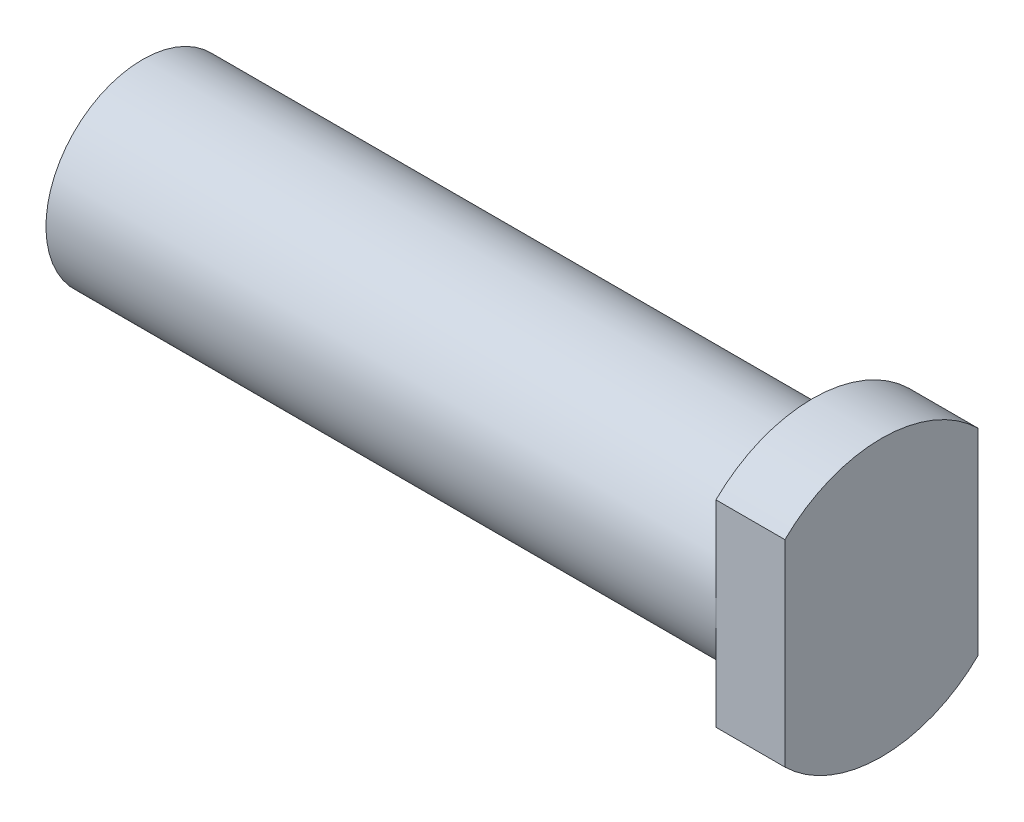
ISO-10303-21;
HEADER;
FILE_DESCRIPTION(('STEP AP214'),'2;1');
FILE_NAME('part.step','',(''),(''),'','','');
FILE_SCHEMA(('AUTOMOTIVE_DESIGN { 1 0 10303 214 1 1 1 1 }'));
ENDSEC;
DATA;
#1=APPLICATION_CONTEXT('core data for automotive mechanical design processes');
#2=APPLICATION_PROTOCOL_DEFINITION('international standard','automotive_design',2000,#1);
#3=PRODUCT_CONTEXT('',#1,'mechanical');
#4=PRODUCT('Part','Part','',(#3));
#5=PRODUCT_RELATED_PRODUCT_CATEGORY('part','',(#4));
#6=PRODUCT_DEFINITION_FORMATION('','',#4);
#7=PRODUCT_DEFINITION_CONTEXT('part definition',#1,'design');
#8=PRODUCT_DEFINITION('design','',#6,#7);
#9=PRODUCT_DEFINITION_SHAPE('','',#8);
#10=(LENGTH_UNIT() NAMED_UNIT(*) SI_UNIT(.MILLI.,.METRE.));
#11=(NAMED_UNIT(*) PLANE_ANGLE_UNIT() SI_UNIT($,.RADIAN.));
#12=(NAMED_UNIT(*) SI_UNIT($,.STERADIAN.) SOLID_ANGLE_UNIT());
#13=UNCERTAINTY_MEASURE_WITH_UNIT(LENGTH_MEASURE(1.E-05),#10,'distance_accuracy_value','');
#14=(GEOMETRIC_REPRESENTATION_CONTEXT(3) GLOBAL_UNCERTAINTY_ASSIGNED_CONTEXT((#13)) GLOBAL_UNIT_ASSIGNED_CONTEXT((#10,
#11,#12)) REPRESENTATION_CONTEXT('',''));
#15=CARTESIAN_POINT('',(0.,0.,0.));
#16=DIRECTION('',(0.,0.,1.));
#17=DIRECTION('',(1.,0.,0.));
#18=AXIS2_PLACEMENT_3D('',#15,#16,#17);
#19=CARTESIAN_POINT('',(48.5778463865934,6.99999999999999,0.));
#20=DIRECTION('',(-1.,0.,0.));
#21=DIRECTION('',(0.,-1.,0.));
#22=AXIS2_PLACEMENT_3D('',#19,#20,#21);
#23=PLANE('',#22);
#24=DIRECTION('',(0.,-1.,0.));
#25=VECTOR('',#24,1.);
#26=CARTESIAN_POINT('',(48.5778463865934,6.99999999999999,7.));
#27=LINE('',#26,#25);
#28=CARTESIAN_POINT('',(48.5778463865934,7.14142842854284,7.));
#29=VERTEX_POINT('',#28);
#30=CARTESIAN_POINT('',(48.5778463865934,0.,7.));
#31=VERTEX_POINT('',#30);
#32=EDGE_CURVE('E123',#29,#31,#27,.T.);
#33=ORIENTED_EDGE('',*,*,#32,.F.);
#34=CARTESIAN_POINT('',(48.5778463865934,0.,0.));
#35=DIRECTION('',(1.,0.,0.));
#36=DIRECTION('',(0.,1.,0.));
#37=AXIS2_PLACEMENT_3D('',#34,#35,#36);
#38=CIRCLE('',#37,9.99999999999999);
#39=CARTESIAN_POINT('',(48.5778463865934,7.14142842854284,-7.));
#40=VERTEX_POINT('',#39);
#41=EDGE_CURVE('E95',#40,#29,#38,.T.);
#42=ORIENTED_EDGE('',*,*,#41,.F.);
#43=DIRECTION('',(0.,1.,0.));
#44=VECTOR('',#43,1.);
#45=CARTESIAN_POINT('',(48.5778463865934,6.99999999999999,-7.));
#46=LINE('',#45,#44);
#47=CARTESIAN_POINT('',(48.5778463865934,0.,-7.));
#48=VERTEX_POINT('',#47);
#49=EDGE_CURVE('E105',#48,#40,#46,.T.);
#50=ORIENTED_EDGE('',*,*,#49,.F.);
#51=CARTESIAN_POINT('',(48.5778463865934,0.,0.));
#52=DIRECTION('',(1.,0.,0.));
#53=DIRECTION('',(0.,1.,0.));
#54=AXIS2_PLACEMENT_3D('',#51,#52,#53);
#55=CIRCLE('',#54,6.99999999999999);
#56=EDGE_CURVE('E109',#48,#31,#55,.T.);
#57=ORIENTED_EDGE('',*,*,#56,.T.);
#58=EDGE_LOOP('',(#33,#42,#50,#57));
#59=FACE_BOUND('',#58,.T.);
#60=ADVANCED_FACE('F38',(#59),#23,.T.);
#61=CARTESIAN_POINT('',(53.5778463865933,0.,0.));
#62=DIRECTION('',(1.,0.,0.));
#63=DIRECTION('',(0.,1.,0.));
#64=AXIS2_PLACEMENT_3D('',#61,#62,#63);
#65=CYLINDRICAL_SURFACE('',#64,9.99999999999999);
#66=DIRECTION('',(1.,0.,0.));
#67=VECTOR('',#66,1.);
#68=CARTESIAN_POINT('',(53.5778463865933,7.14142842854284,7.));
#69=LINE('',#68,#67);
#70=CARTESIAN_POINT('',(53.5778463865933,7.14142842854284,7.));
#71=VERTEX_POINT('',#70);
#72=EDGE_CURVE('E84',#71,#29,#69,.F.);
#73=ORIENTED_EDGE('',*,*,#72,.F.);
#74=CARTESIAN_POINT('',(53.5778463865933,0.,0.));
#75=DIRECTION('',(1.,0.,0.));
#76=DIRECTION('',(0.,1.,0.));
#77=AXIS2_PLACEMENT_3D('',#74,#75,#76);
#78=CIRCLE('',#77,9.99999999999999);
#79=CARTESIAN_POINT('',(53.5778463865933,7.14142842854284,-7.));
#80=VERTEX_POINT('',#79);
#81=EDGE_CURVE('E93',#80,#71,#78,.T.);
#82=ORIENTED_EDGE('',*,*,#81,.F.);
#83=DIRECTION('',(1.,0.,0.));
#84=VECTOR('',#83,1.);
#85=CARTESIAN_POINT('',(53.5778463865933,7.14142842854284,-7.));
#86=LINE('',#85,#84);
#87=EDGE_CURVE('E60',#40,#80,#86,.T.);
#88=ORIENTED_EDGE('',*,*,#87,.F.);
#89=ORIENTED_EDGE('',*,*,#41,.T.);
#90=EDGE_LOOP('',(#73,#82,#88,#89));
#91=FACE_BOUND('',#90,.T.);
#92=ADVANCED_FACE('F92',(#91),#65,.T.);
#93=CARTESIAN_POINT('',(0.,0.,0.));
#94=DIRECTION('',(-1.,0.,0.));
#95=DIRECTION('',(0.,-1.,0.));
#96=AXIS2_PLACEMENT_3D('',#93,#94,#95);
#97=PLANE('',#96);
#98=CARTESIAN_POINT('',(0.,0.,0.));
#99=DIRECTION('',(1.,0.,0.));
#100=DIRECTION('',(0.,1.,0.));
#101=AXIS2_PLACEMENT_3D('',#98,#99,#100);
#102=CIRCLE('',#101,6.99999999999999);
#103=CARTESIAN_POINT('',(0.,6.99999999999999,0.));
#104=VERTEX_POINT('',#103);
#105=EDGE_CURVE('E112',#104,#104,#102,.T.);
#106=ORIENTED_EDGE('',*,*,#105,.F.);
#107=EDGE_LOOP('',(#106));
#108=FACE_BOUND('',#107,.T.);
#109=ADVANCED_FACE('F40',(#108),#97,.T.);
#110=CARTESIAN_POINT('',(53.5778463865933,0.,0.));
#111=DIRECTION('',(1.,0.,0.));
#112=DIRECTION('',(0.,1.,0.));
#113=AXIS2_PLACEMENT_3D('',#110,#111,#112);
#114=CYLINDRICAL_SURFACE('',#113,6.99999999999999);
#115=ORIENTED_EDGE('',*,*,#105,.T.);
#116=EDGE_LOOP('',(#115));
#117=FACE_BOUND('',#116,.T.);
#118=ORIENTED_EDGE('',*,*,#56,.F.);
#119=EDGE_CURVE('E108',#31,#48,#55,.T.);
#120=ORIENTED_EDGE('',*,*,#119,.F.);
#121=EDGE_LOOP('',(#118,#120));
#122=FACE_BOUND('',#121,.T.);
#123=ADVANCED_FACE('F134',(#117,#122),#114,.T.);
#124=CARTESIAN_POINT('',(48.5778463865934,-7.14142842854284,7.));
#125=VERTEX_POINT('',#124);
#126=EDGE_CURVE('E96',#31,#125,#27,.T.);
#127=ORIENTED_EDGE('',*,*,#126,.F.);
#128=ORIENTED_EDGE('',*,*,#119,.T.);
#129=CARTESIAN_POINT('',(48.5778463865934,-7.14142842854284,-7.));
#130=VERTEX_POINT('',#129);
#131=EDGE_CURVE('E103',#130,#48,#46,.T.);
#132=ORIENTED_EDGE('',*,*,#131,.F.);
#133=EDGE_CURVE('E99',#125,#130,#38,.T.);
#134=ORIENTED_EDGE('',*,*,#133,.F.);
#135=EDGE_LOOP('',(#127,#128,#132,#134));
#136=FACE_BOUND('',#135,.T.);
#137=ADVANCED_FACE('F131',(#136),#23,.T.);
#138=DIRECTION('',(1.,0.,0.));
#139=VECTOR('',#138,1.);
#140=CARTESIAN_POINT('',(53.5778463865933,-7.14142842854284,7.));
#141=LINE('',#140,#139);
#142=CARTESIAN_POINT('',(53.5778463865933,-7.14142842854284,7.));
#143=VERTEX_POINT('',#142);
#144=EDGE_CURVE('E52',#125,#143,#141,.T.);
#145=ORIENTED_EDGE('',*,*,#144,.F.);
#146=ORIENTED_EDGE('',*,*,#133,.T.);
#147=DIRECTION('',(1.,0.,0.));
#148=VECTOR('',#147,1.);
#149=CARTESIAN_POINT('',(53.5778463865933,-7.14142842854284,-7.));
#150=LINE('',#149,#148);
#151=CARTESIAN_POINT('',(53.5778463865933,-7.14142842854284,-7.));
#152=VERTEX_POINT('',#151);
#153=EDGE_CURVE('E118',#152,#130,#150,.F.);
#154=ORIENTED_EDGE('',*,*,#153,.F.);
#155=EDGE_CURVE('E100',#143,#152,#78,.T.);
#156=ORIENTED_EDGE('',*,*,#155,.F.);
#157=EDGE_LOOP('',(#145,#146,#154,#156));
#158=FACE_BOUND('',#157,.T.);
#159=ADVANCED_FACE('F121',(#158),#65,.T.);
#160=CARTESIAN_POINT('',(53.5778463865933,9.99999999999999,0.));
#161=DIRECTION('',(1.,0.,0.));
#162=DIRECTION('',(0.,1.,0.));
#163=AXIS2_PLACEMENT_3D('',#160,#161,#162);
#164=PLANE('',#163);
#165=DIRECTION('',(0.,1.,0.));
#166=VECTOR('',#165,1.);
#167=CARTESIAN_POINT('',(53.5778463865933,9.99999999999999,7.));
#168=LINE('',#167,#166);
#169=EDGE_CURVE('E11',#143,#71,#168,.T.);
#170=ORIENTED_EDGE('',*,*,#169,.F.);
#171=ORIENTED_EDGE('',*,*,#155,.T.);
#172=DIRECTION('',(0.,-1.,0.));
#173=VECTOR('',#172,1.);
#174=CARTESIAN_POINT('',(53.5778463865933,9.99999999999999,-7.));
#175=LINE('',#174,#173);
#176=EDGE_CURVE('E46',#80,#152,#175,.T.);
#177=ORIENTED_EDGE('',*,*,#176,.F.);
#178=ORIENTED_EDGE('',*,*,#81,.T.);
#179=EDGE_LOOP('',(#170,#171,#177,#178));
#180=FACE_BOUND('',#179,.T.);
#181=ADVANCED_FACE('F98',(#180),#164,.T.);
#182=CARTESIAN_POINT('',(47.5778463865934,-9.99999999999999,-7.));
#183=DIRECTION('',(0.,0.,1.));
#184=DIRECTION('',(1.,0.,0.));
#185=AXIS2_PLACEMENT_3D('',#182,#183,#184);
#186=PLANE('',#185);
#187=ORIENTED_EDGE('',*,*,#131,.T.);
#188=ORIENTED_EDGE('',*,*,#49,.T.);
#189=ORIENTED_EDGE('',*,*,#87,.T.);
#190=ORIENTED_EDGE('',*,*,#176,.T.);
#191=ORIENTED_EDGE('',*,*,#153,.T.);
#192=EDGE_LOOP('',(#187,#188,#189,#190,#191));
#193=FACE_BOUND('',#192,.T.);
#194=ADVANCED_FACE('F117',(#193),#186,.F.);
#195=CARTESIAN_POINT('',(47.5778463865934,-9.99999999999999,7.));
#196=DIRECTION('',(0.,0.,-1.));
#197=DIRECTION('',(-1.,0.,0.));
#198=AXIS2_PLACEMENT_3D('',#195,#196,#197);
#199=PLANE('',#198);
#200=ORIENTED_EDGE('',*,*,#32,.T.);
#201=ORIENTED_EDGE('',*,*,#126,.T.);
#202=ORIENTED_EDGE('',*,*,#144,.T.);
#203=ORIENTED_EDGE('',*,*,#169,.T.);
#204=ORIENTED_EDGE('',*,*,#72,.T.);
#205=EDGE_LOOP('',(#200,#201,#202,#203,#204));
#206=FACE_BOUND('',#205,.T.);
#207=ADVANCED_FACE('F83',(#206),#199,.F.);
#208=CLOSED_SHELL('',(#60,#92,#109,#123,#137,#159,#181,#194,#207));
#209=MANIFOLD_SOLID_BREP('B2',#208);
#210=ADVANCED_BREP_SHAPE_REPRESENTATION('',(#18,#209),#14);
#211=SHAPE_DEFINITION_REPRESENTATION(#9,#210);
ENDSEC;
END-ISO-10303-21;
